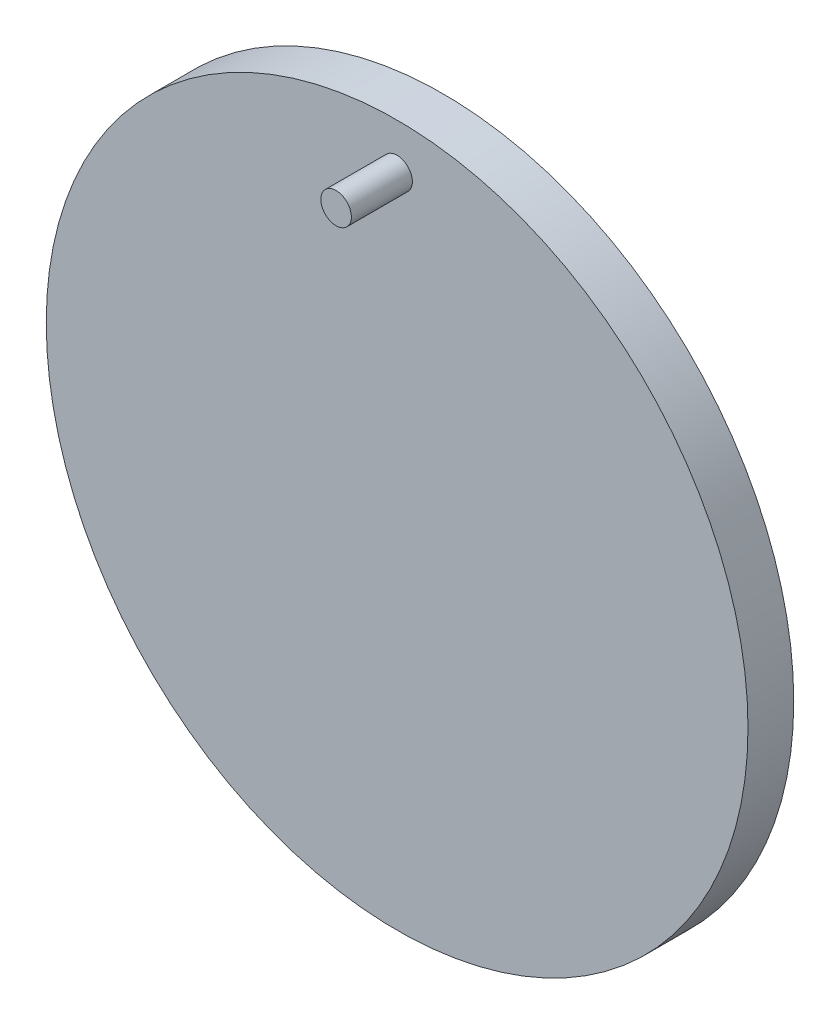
ISO-10303-21;
HEADER;
FILE_DESCRIPTION(('STEP AP214'),'2;1');
FILE_NAME('part.step','',(''),(''),'','','');
FILE_SCHEMA(('AUTOMOTIVE_DESIGN { 1 0 10303 214 1 1 1 1 }'));
ENDSEC;
DATA;
#1=APPLICATION_CONTEXT('core data for automotive mechanical design processes');
#2=APPLICATION_PROTOCOL_DEFINITION('international standard','automotive_design',2000,#1);
#3=PRODUCT_CONTEXT('',#1,'mechanical');
#4=PRODUCT('Part','Part','',(#3));
#5=PRODUCT_RELATED_PRODUCT_CATEGORY('part','',(#4));
#6=PRODUCT_DEFINITION_FORMATION('','',#4);
#7=PRODUCT_DEFINITION_CONTEXT('part definition',#1,'design');
#8=PRODUCT_DEFINITION('design','',#6,#7);
#9=PRODUCT_DEFINITION_SHAPE('','',#8);
#10=(LENGTH_UNIT() NAMED_UNIT(*) SI_UNIT(.MILLI.,.METRE.));
#11=(NAMED_UNIT(*) PLANE_ANGLE_UNIT() SI_UNIT($,.RADIAN.));
#12=(NAMED_UNIT(*) SI_UNIT($,.STERADIAN.) SOLID_ANGLE_UNIT());
#13=UNCERTAINTY_MEASURE_WITH_UNIT(LENGTH_MEASURE(1.E-05),#10,'distance_accuracy_value','');
#14=(GEOMETRIC_REPRESENTATION_CONTEXT(3) GLOBAL_UNCERTAINTY_ASSIGNED_CONTEXT((#13)) GLOBAL_UNIT_ASSIGNED_CONTEXT((#10,
#11,#12)) REPRESENTATION_CONTEXT('',''));
#15=CARTESIAN_POINT('',(0.,0.,0.));
#16=DIRECTION('',(0.,0.,1.));
#17=DIRECTION('',(1.,0.,0.));
#18=AXIS2_PLACEMENT_3D('',#15,#16,#17);
#19=CARTESIAN_POINT('',(0.,0.,0.));
#20=DIRECTION('',(0.,0.,1.));
#21=DIRECTION('',(1.,0.,0.));
#22=AXIS2_PLACEMENT_3D('',#19,#20,#21);
#23=PLANE('',#22);
#24=CARTESIAN_POINT('',(0.,0.,0.));
#25=DIRECTION('',(0.,0.,1.));
#26=DIRECTION('',(1.,0.,0.));
#27=AXIS2_PLACEMENT_3D('',#24,#25,#26);
#28=CIRCLE('',#27,115.);
#29=CARTESIAN_POINT('',(115.,0.,0.));
#30=VERTEX_POINT('',#29);
#31=EDGE_CURVE('E34',#30,#30,#28,.T.);
#32=ORIENTED_EDGE('',*,*,#31,.T.);
#33=EDGE_LOOP('',(#32));
#34=FACE_BOUND('',#33,.T.);
#35=CARTESIAN_POINT('',(0.,100.,0.));
#36=DIRECTION('',(0.,0.,1.));
#37=DIRECTION('',(1.,0.,0.));
#38=AXIS2_PLACEMENT_3D('',#35,#36,#37);
#39=CIRCLE('',#38,5.);
#40=CARTESIAN_POINT('',(5.,100.,0.));
#41=VERTEX_POINT('',#40);
#42=EDGE_CURVE('E42',#41,#41,#39,.T.);
#43=ORIENTED_EDGE('',*,*,#42,.F.);
#44=EDGE_LOOP('',(#43));
#45=FACE_BOUND('',#44,.T.);
#46=ADVANCED_FACE('F27',(#34,#45),#23,.T.);
#47=CARTESIAN_POINT('',(0.,0.,-15.));
#48=DIRECTION('',(0.,0.,1.));
#49=DIRECTION('',(1.,0.,0.));
#50=AXIS2_PLACEMENT_3D('',#47,#48,#49);
#51=CYLINDRICAL_SURFACE('',#50,115.);
#52=CARTESIAN_POINT('',(0.,0.,-15.));
#53=DIRECTION('',(0.,0.,1.));
#54=DIRECTION('',(1.,0.,0.));
#55=AXIS2_PLACEMENT_3D('',#52,#53,#54);
#56=CIRCLE('',#55,115.);
#57=CARTESIAN_POINT('',(115.,0.,-15.));
#58=VERTEX_POINT('',#57);
#59=EDGE_CURVE('E10',#58,#58,#56,.T.);
#60=ORIENTED_EDGE('',*,*,#59,.T.);
#61=EDGE_LOOP('',(#60));
#62=FACE_BOUND('',#61,.T.);
#63=ORIENTED_EDGE('',*,*,#31,.F.);
#64=EDGE_LOOP('',(#63));
#65=FACE_BOUND('',#64,.T.);
#66=ADVANCED_FACE('F29',(#62,#65),#51,.T.);
#67=CARTESIAN_POINT('',(0.,0.,-15.));
#68=DIRECTION('',(0.,0.,1.));
#69=DIRECTION('',(1.,0.,0.));
#70=AXIS2_PLACEMENT_3D('',#67,#68,#69);
#71=PLANE('',#70);
#72=ORIENTED_EDGE('',*,*,#59,.F.);
#73=EDGE_LOOP('',(#72));
#74=FACE_BOUND('',#73,.T.);
#75=ADVANCED_FACE('F57',(#74),#71,.F.);
#76=CARTESIAN_POINT('',(0.,100.,20.));
#77=DIRECTION('',(0.,0.,-1.));
#78=DIRECTION('',(-1.,0.,0.));
#79=AXIS2_PLACEMENT_3D('',#76,#77,#78);
#80=CYLINDRICAL_SURFACE('',#79,5.);
#81=CARTESIAN_POINT('',(0.,100.,20.));
#82=DIRECTION('',(0.,0.,1.));
#83=DIRECTION('',(1.,0.,0.));
#84=AXIS2_PLACEMENT_3D('',#81,#82,#83);
#85=CIRCLE('',#84,5.);
#86=CARTESIAN_POINT('',(5.,100.,20.));
#87=VERTEX_POINT('',#86);
#88=EDGE_CURVE('E38',#87,#87,#85,.T.);
#89=ORIENTED_EDGE('',*,*,#88,.F.);
#90=EDGE_LOOP('',(#89));
#91=FACE_BOUND('',#90,.T.);
#92=ORIENTED_EDGE('',*,*,#42,.T.);
#93=EDGE_LOOP('',(#92));
#94=FACE_BOUND('',#93,.T.);
#95=ADVANCED_FACE('F48',(#91,#94),#80,.T.);
#96=CARTESIAN_POINT('',(0.,100.,20.));
#97=DIRECTION('',(0.,0.,1.));
#98=DIRECTION('',(1.,0.,0.));
#99=AXIS2_PLACEMENT_3D('',#96,#97,#98);
#100=PLANE('',#99);
#101=ORIENTED_EDGE('',*,*,#88,.T.);
#102=EDGE_LOOP('',(#101));
#103=FACE_BOUND('',#102,.T.);
#104=ADVANCED_FACE('F63',(#103),#100,.T.);
#105=CLOSED_SHELL('',(#46,#66,#75,#95,#104));
#106=MANIFOLD_SOLID_BREP('B2',#105);
#107=ADVANCED_BREP_SHAPE_REPRESENTATION('',(#18,#106),#14);
#108=SHAPE_DEFINITION_REPRESENTATION(#9,#107);
ENDSEC;
END-ISO-10303-21;
